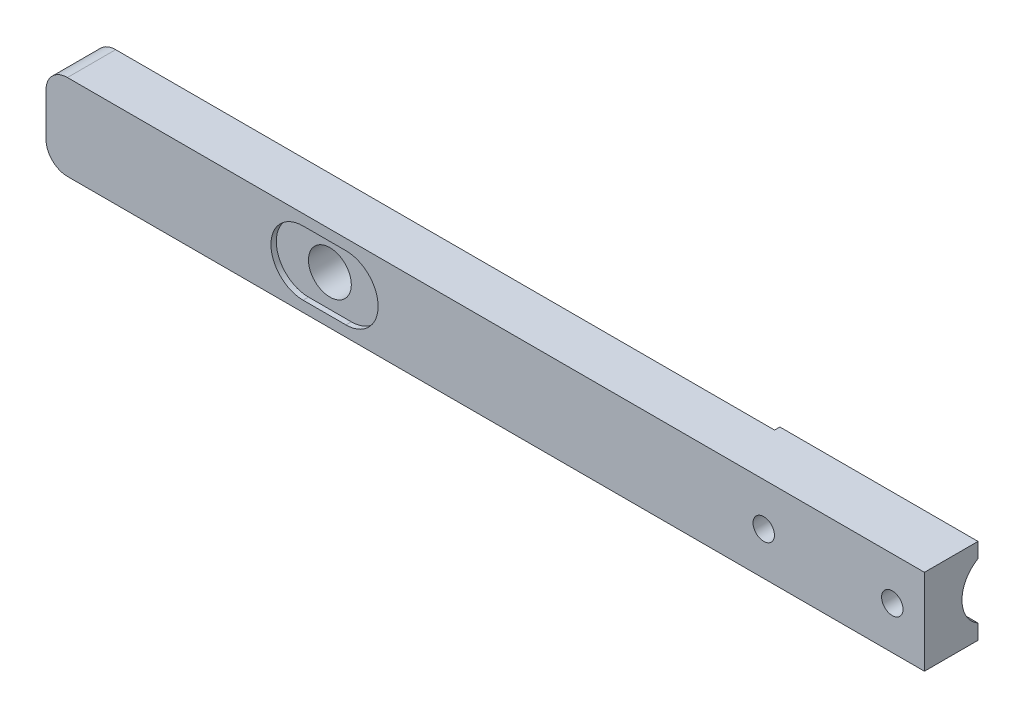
ISO-10303-21;
HEADER;
FILE_DESCRIPTION(('STEP AP214'),'2;1');
FILE_NAME('part.step','',(''),(''),'','','');
FILE_SCHEMA(('AUTOMOTIVE_DESIGN { 1 0 10303 214 1 1 1 1 }'));
ENDSEC;
DATA;
#1=APPLICATION_CONTEXT('core data for automotive mechanical design processes');
#2=APPLICATION_PROTOCOL_DEFINITION('international standard','automotive_design',2000,#1);
#3=PRODUCT_CONTEXT('',#1,'mechanical');
#4=PRODUCT('Part','Part','',(#3));
#5=PRODUCT_RELATED_PRODUCT_CATEGORY('part','',(#4));
#6=PRODUCT_DEFINITION_FORMATION('','',#4);
#7=PRODUCT_DEFINITION_CONTEXT('part definition',#1,'design');
#8=PRODUCT_DEFINITION('design','',#6,#7);
#9=PRODUCT_DEFINITION_SHAPE('','',#8);
#10=(LENGTH_UNIT() NAMED_UNIT(*) SI_UNIT(.MILLI.,.METRE.));
#11=(NAMED_UNIT(*) PLANE_ANGLE_UNIT() SI_UNIT($,.RADIAN.));
#12=(NAMED_UNIT(*) SI_UNIT($,.STERADIAN.) SOLID_ANGLE_UNIT());
#13=UNCERTAINTY_MEASURE_WITH_UNIT(LENGTH_MEASURE(1.E-05),#10,'distance_accuracy_value','');
#14=(GEOMETRIC_REPRESENTATION_CONTEXT(3) GLOBAL_UNCERTAINTY_ASSIGNED_CONTEXT((#13)) GLOBAL_UNIT_ASSIGNED_CONTEXT((#10,
#11,#12)) REPRESENTATION_CONTEXT('',''));
#15=CARTESIAN_POINT('',(0.,0.,0.));
#16=DIRECTION('',(0.,0.,1.));
#17=DIRECTION('',(1.,0.,0.));
#18=AXIS2_PLACEMENT_3D('',#15,#16,#17);
#19=CARTESIAN_POINT('',(0.,0.,7.9375));
#20=DIRECTION('',(0.,0.,1.));
#21=DIRECTION('',(1.,0.,0.));
#22=AXIS2_PLACEMENT_3D('',#19,#20,#21);
#23=PLANE('',#22);
#24=CARTESIAN_POINT('',(130.175,0.,7.9375));
#25=DIRECTION('',(0.,0.,1.));
#26=DIRECTION('',(1.,0.,0.));
#27=AXIS2_PLACEMENT_3D('',#24,#25,#26);
#28=CIRCLE('',#27,3.175);
#29=CARTESIAN_POINT('',(133.35,0.,7.9375));
#30=VERTEX_POINT('',#29);
#31=EDGE_CURVE('E356',#30,#30,#28,.T.);
#32=ORIENTED_EDGE('',*,*,#31,.F.);
#33=EDGE_LOOP('',(#32));
#34=FACE_BOUND('',#33,.T.);
#35=DIRECTION('',(0.,-1.,0.));
#36=VECTOR('',#35,1.);
#37=CARTESIAN_POINT('',(-82.55,12.7,7.9375));
#38=LINE('',#37,#36);
#39=CARTESIAN_POINT('',(-82.55,6.35,7.9375));
#40=VERTEX_POINT('',#39);
#41=CARTESIAN_POINT('',(-82.55,-6.35,7.9375));
#42=VERTEX_POINT('',#41);
#43=EDGE_CURVE('E328',#40,#42,#38,.T.);
#44=ORIENTED_EDGE('',*,*,#43,.T.);
#45=CARTESIAN_POINT('',(-76.2,-6.35,7.9375));
#46=DIRECTION('',(0.,0.,1.));
#47=DIRECTION('',(1.,0.,0.));
#48=AXIS2_PLACEMENT_3D('',#45,#46,#47);
#49=CIRCLE('',#48,6.35);
#50=CARTESIAN_POINT('',(-76.2,-12.7,7.9375));
#51=VERTEX_POINT('',#50);
#52=EDGE_CURVE('E312',#42,#51,#49,.T.);
#53=ORIENTED_EDGE('',*,*,#52,.T.);
#54=DIRECTION('',(1.,0.,0.));
#55=VECTOR('',#54,1.);
#56=CARTESIAN_POINT('',(-82.55,-12.7,7.9375));
#57=LINE('',#56,#55);
#58=CARTESIAN_POINT('',(177.8,-12.7,7.9375));
#59=VERTEX_POINT('',#58);
#60=EDGE_CURVE('E299',#51,#59,#57,.T.);
#61=ORIENTED_EDGE('',*,*,#60,.T.);
#62=DIRECTION('',(0.,1.,0.));
#63=VECTOR('',#62,1.);
#64=CARTESIAN_POINT('',(177.8,-12.7,7.9375));
#65=LINE('',#64,#63);
#66=CARTESIAN_POINT('',(177.8,12.7,7.9375));
#67=VERTEX_POINT('',#66);
#68=EDGE_CURVE('E324',#59,#67,#65,.T.);
#69=ORIENTED_EDGE('',*,*,#68,.T.);
#70=DIRECTION('',(-1.,0.,0.));
#71=VECTOR('',#70,1.);
#72=CARTESIAN_POINT('',(177.8,12.7,7.9375));
#73=LINE('',#72,#71);
#74=CARTESIAN_POINT('',(-76.2,12.7,7.9375));
#75=VERTEX_POINT('',#74);
#76=EDGE_CURVE('E319',#67,#75,#73,.T.);
#77=ORIENTED_EDGE('',*,*,#76,.T.);
#78=CARTESIAN_POINT('',(-76.2,6.35,7.9375));
#79=DIRECTION('',(0.,0.,1.));
#80=DIRECTION('',(1.,0.,0.));
#81=AXIS2_PLACEMENT_3D('',#78,#79,#80);
#82=CIRCLE('',#81,6.35);
#83=EDGE_CURVE('E311',#75,#40,#82,.T.);
#84=ORIENTED_EDGE('',*,*,#83,.T.);
#85=EDGE_LOOP('',(#44,#53,#61,#69,#77,#84));
#86=FACE_BOUND('',#85,.T.);
#87=CARTESIAN_POINT('',(168.275,0.,7.9375));
#88=DIRECTION('',(0.,0.,1.));
#89=DIRECTION('',(1.,0.,0.));
#90=AXIS2_PLACEMENT_3D('',#87,#88,#89);
#91=CIRCLE('',#90,3.175);
#92=CARTESIAN_POINT('',(171.45,0.,7.9375));
#93=VERTEX_POINT('',#92);
#94=EDGE_CURVE('E335',#93,#93,#91,.T.);
#95=ORIENTED_EDGE('',*,*,#94,.F.);
#96=EDGE_LOOP('',(#95));
#97=FACE_BOUND('',#96,.T.);
#98=DIRECTION('',(-1.,0.,0.));
#99=VECTOR('',#98,1.);
#100=CARTESIAN_POINT('',(0.,-9.525,7.9375));
#101=LINE('',#100,#99);
#102=CARTESIAN_POINT('',(6.35,-9.525,7.93750000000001));
#103=VERTEX_POINT('',#102);
#104=CARTESIAN_POINT('',(-6.35,-9.525,7.93750000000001));
#105=VERTEX_POINT('',#104);
#106=EDGE_CURVE('E41',#103,#105,#101,.T.);
#107=ORIENTED_EDGE('',*,*,#106,.T.);
#108=CARTESIAN_POINT('',(-6.35,0.,7.9375));
#109=DIRECTION('',(0.,0.,1.));
#110=DIRECTION('',(1.,0.,0.));
#111=AXIS2_PLACEMENT_3D('',#108,#109,#110);
#112=CIRCLE('',#111,9.525);
#113=CARTESIAN_POINT('',(-6.35,9.525,7.93750000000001));
#114=VERTEX_POINT('',#113);
#115=EDGE_CURVE('E11',#105,#114,#112,.F.);
#116=ORIENTED_EDGE('',*,*,#115,.T.);
#117=DIRECTION('',(1.,0.,0.));
#118=VECTOR('',#117,1.);
#119=CARTESIAN_POINT('',(0.,9.525,7.9375));
#120=LINE('',#119,#118);
#121=CARTESIAN_POINT('',(6.35,9.525,7.9375));
#122=VERTEX_POINT('',#121);
#123=EDGE_CURVE('E231',#114,#122,#120,.T.);
#124=ORIENTED_EDGE('',*,*,#123,.T.);
#125=CARTESIAN_POINT('',(6.35,0.,7.9375));
#126=DIRECTION('',(0.,0.,1.));
#127=DIRECTION('',(1.,0.,0.));
#128=AXIS2_PLACEMENT_3D('',#125,#126,#127);
#129=CIRCLE('',#128,9.525);
#130=EDGE_CURVE('E236',#122,#103,#129,.F.);
#131=ORIENTED_EDGE('',*,*,#130,.T.);
#132=EDGE_LOOP('',(#107,#116,#124,#131));
#133=FACE_BOUND('',#132,.T.);
#134=ADVANCED_FACE('F33',(#34,#86,#97,#133),#23,.T.);
#135=CARTESIAN_POINT('',(0.,0.,7.9375));
#136=DIRECTION('',(0.,0.,-1.));
#137=DIRECTION('',(-1.,0.,0.));
#138=AXIS2_PLACEMENT_3D('',#135,#136,#137);
#139=CYLINDRICAL_SURFACE('',#138,6.35);
#140=CARTESIAN_POINT('',(0.,0.,-6.36269999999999));
#141=DIRECTION('',(0.,0.,1.));
#142=DIRECTION('',(1.,0.,0.));
#143=AXIS2_PLACEMENT_3D('',#140,#141,#142);
#144=CIRCLE('',#143,6.35);
#145=CARTESIAN_POINT('',(6.35,0.,-6.36269999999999));
#146=VERTEX_POINT('',#145);
#147=EDGE_CURVE('E180',#146,#146,#144,.T.);
#148=ORIENTED_EDGE('',*,*,#147,.F.);
#149=EDGE_LOOP('',(#148));
#150=FACE_BOUND('',#149,.T.);
#151=CARTESIAN_POINT('',(0.,0.,6.35));
#152=DIRECTION('',(0.,0.,1.));
#153=DIRECTION('',(1.,0.,0.));
#154=AXIS2_PLACEMENT_3D('',#151,#152,#153);
#155=CIRCLE('',#154,6.35);
#156=CARTESIAN_POINT('',(6.35,0.,6.35));
#157=VERTEX_POINT('',#156);
#158=EDGE_CURVE('E142',#157,#157,#155,.T.);
#159=ORIENTED_EDGE('',*,*,#158,.T.);
#160=EDGE_LOOP('',(#159));
#161=FACE_BOUND('',#160,.T.);
#162=ADVANCED_FACE('F252',(#150,#161),#139,.F.);
#163=CARTESIAN_POINT('',(0.,0.,-7.9375));
#164=DIRECTION('',(0.,0.,1.));
#165=DIRECTION('',(1.,0.,0.));
#166=AXIS2_PLACEMENT_3D('',#163,#164,#165);
#167=PLANE('',#166);
#168=DIRECTION('',(1.,0.,0.));
#169=VECTOR('',#168,1.);
#170=CARTESIAN_POINT('',(-82.55,-12.7,-7.9375));
#171=LINE('',#170,#169);
#172=CARTESIAN_POINT('',(119.0752,-12.7,-7.9375));
#173=VERTEX_POINT('',#172);
#174=CARTESIAN_POINT('',(177.8,-12.7,-7.9375));
#175=VERTEX_POINT('',#174);
#176=EDGE_CURVE('E339',#173,#175,#171,.T.);
#177=ORIENTED_EDGE('',*,*,#176,.F.);
#178=DIRECTION('',(0.,1.,0.));
#179=VECTOR('',#178,1.);
#180=CARTESIAN_POINT('',(119.0752,-25.4,-7.9375));
#181=LINE('',#180,#179);
#182=CARTESIAN_POINT('',(119.0752,12.7,-7.9375));
#183=VERTEX_POINT('',#182);
#184=EDGE_CURVE('E165',#173,#183,#181,.T.);
#185=ORIENTED_EDGE('',*,*,#184,.T.);
#186=DIRECTION('',(-1.,0.,0.));
#187=VECTOR('',#186,1.);
#188=CARTESIAN_POINT('',(177.8,12.7,-7.9375));
#189=LINE('',#188,#187);
#190=CARTESIAN_POINT('',(177.8,12.7,-7.9375));
#191=VERTEX_POINT('',#190);
#192=EDGE_CURVE('E329',#191,#183,#189,.T.);
#193=ORIENTED_EDGE('',*,*,#192,.F.);
#194=DIRECTION('',(0.,1.,0.));
#195=VECTOR('',#194,1.);
#196=CARTESIAN_POINT('',(177.8,-12.7,-7.9375));
#197=LINE('',#196,#195);
#198=CARTESIAN_POINT('',(177.8,8.24889197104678,-7.9375));
#199=VERTEX_POINT('',#198);
#200=EDGE_CURVE('E341',#199,#191,#197,.T.);
#201=ORIENTED_EDGE('',*,*,#200,.F.);
#202=DIRECTION('',(1.,0.,0.));
#203=VECTOR('',#202,1.);
#204=CARTESIAN_POINT('',(120.65,8.24889197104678,-7.9375));
#205=LINE('',#204,#203);
#206=CARTESIAN_POINT('',(120.65,8.24889197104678,-7.9375));
#207=VERTEX_POINT('',#206);
#208=EDGE_CURVE('E199',#199,#207,#205,.F.);
#209=ORIENTED_EDGE('',*,*,#208,.T.);
#210=DIRECTION('',(0.,1.,0.));
#211=VECTOR('',#210,1.);
#212=CARTESIAN_POINT('',(120.65,0.,-7.9375));
#213=LINE('',#212,#211);
#214=CARTESIAN_POINT('',(120.65,-8.24889197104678,-7.9375));
#215=VERTEX_POINT('',#214);
#216=EDGE_CURVE('E224',#215,#207,#213,.T.);
#217=ORIENTED_EDGE('',*,*,#216,.F.);
#218=DIRECTION('',(1.,0.,0.));
#219=VECTOR('',#218,1.);
#220=CARTESIAN_POINT('',(120.65,-8.24889197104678,-7.9375));
#221=LINE('',#220,#219);
#222=CARTESIAN_POINT('',(177.8,-8.24889197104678,-7.9375));
#223=VERTEX_POINT('',#222);
#224=EDGE_CURVE('E353',#215,#223,#221,.T.);
#225=ORIENTED_EDGE('',*,*,#224,.T.);
#226=EDGE_CURVE('E332',#175,#223,#197,.T.);
#227=ORIENTED_EDGE('',*,*,#226,.F.);
#228=EDGE_LOOP('',(#177,#185,#193,#201,#209,#217,#225,#227));
#229=FACE_BOUND('',#228,.T.);
#230=ADVANCED_FACE('F258',(#229),#167,.F.);
#231=CARTESIAN_POINT('',(-82.55,12.7,7.9375));
#232=DIRECTION('',(1.,0.,0.));
#233=DIRECTION('',(0.,0.,-1.));
#234=AXIS2_PLACEMENT_3D('',#231,#232,#233);
#235=PLANE('',#234);
#236=DIRECTION('',(0.,0.,-1.));
#237=VECTOR('',#236,1.);
#238=CARTESIAN_POINT('',(-82.55,6.35,7.9375));
#239=LINE('',#238,#237);
#240=CARTESIAN_POINT('',(-82.55,6.35,-6.36269999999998));
#241=VERTEX_POINT('',#240);
#242=EDGE_CURVE('E300',#40,#241,#239,.T.);
#243=ORIENTED_EDGE('',*,*,#242,.T.);
#244=DIRECTION('',(0.,1.,0.));
#245=VECTOR('',#244,1.);
#246=CARTESIAN_POINT('',(-82.55,-25.4,-6.36269999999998));
#247=LINE('',#246,#245);
#248=CARTESIAN_POINT('',(-82.55,-6.35,-6.36269999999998));
#249=VERTEX_POINT('',#248);
#250=EDGE_CURVE('E56',#249,#241,#247,.T.);
#251=ORIENTED_EDGE('',*,*,#250,.F.);
#252=DIRECTION('',(0.,0.,-1.));
#253=VECTOR('',#252,1.);
#254=CARTESIAN_POINT('',(-82.55,-6.35,7.9375));
#255=LINE('',#254,#253);
#256=EDGE_CURVE('E296',#249,#42,#255,.F.);
#257=ORIENTED_EDGE('',*,*,#256,.T.);
#258=ORIENTED_EDGE('',*,*,#43,.F.);
#259=EDGE_LOOP('',(#243,#251,#257,#258));
#260=FACE_BOUND('',#259,.T.);
#261=ADVANCED_FACE('F265',(#260),#235,.F.);
#262=CARTESIAN_POINT('',(-82.55,-12.7,7.9375));
#263=DIRECTION('',(0.,1.,0.));
#264=DIRECTION('',(0.,0.,1.));
#265=AXIS2_PLACEMENT_3D('',#262,#263,#264);
#266=PLANE('',#265);
#267=DIRECTION('',(1.,0.,0.));
#268=VECTOR('',#267,1.);
#269=CARTESIAN_POINT('',(-82.55,-12.7,-6.36269999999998));
#270=LINE('',#269,#268);
#271=CARTESIAN_POINT('',(-76.2,-12.7,-6.36269999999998));
#272=VERTEX_POINT('',#271);
#273=CARTESIAN_POINT('',(119.0752,-12.7,-6.3627));
#274=VERTEX_POINT('',#273);
#275=EDGE_CURVE('E177',#272,#274,#270,.T.);
#276=ORIENTED_EDGE('',*,*,#275,.T.);
#277=DIRECTION('',(0.,0.,-1.));
#278=VECTOR('',#277,1.);
#279=CARTESIAN_POINT('',(119.0752,-12.7,7.9375));
#280=LINE('',#279,#278);
#281=EDGE_CURVE('E183',#274,#173,#280,.T.);
#282=ORIENTED_EDGE('',*,*,#281,.T.);
#283=ORIENTED_EDGE('',*,*,#176,.T.);
#284=DIRECTION('',(0.,0.,-1.));
#285=VECTOR('',#284,1.);
#286=CARTESIAN_POINT('',(177.8,-12.7,7.9375));
#287=LINE('',#286,#285);
#288=EDGE_CURVE('E301',#59,#175,#287,.T.);
#289=ORIENTED_EDGE('',*,*,#288,.F.);
#290=ORIENTED_EDGE('',*,*,#60,.F.);
#291=DIRECTION('',(0.,0.,-1.));
#292=VECTOR('',#291,1.);
#293=CARTESIAN_POINT('',(-76.2,-12.7,7.9375));
#294=LINE('',#293,#292);
#295=EDGE_CURVE('E295',#51,#272,#294,.T.);
#296=ORIENTED_EDGE('',*,*,#295,.T.);
#297=EDGE_LOOP('',(#276,#282,#283,#289,#290,#296));
#298=FACE_BOUND('',#297,.T.);
#299=ADVANCED_FACE('F274',(#298),#266,.F.);
#300=CARTESIAN_POINT('',(177.8,-12.7,7.9375));
#301=DIRECTION('',(-1.,0.,0.));
#302=DIRECTION('',(0.,0.,1.));
#303=AXIS2_PLACEMENT_3D('',#300,#301,#302);
#304=PLANE('',#303);
#305=ORIENTED_EDGE('',*,*,#226,.T.);
#306=CARTESIAN_POINT('',(177.8,0.,-12.7));
#307=DIRECTION('',(1.,0.,0.));
#308=DIRECTION('',(0.,0.,-1.));
#309=AXIS2_PLACEMENT_3D('',#306,#307,#308);
#310=CIRCLE('',#309,9.525);
#311=EDGE_CURVE('E186',#199,#223,#310,.T.);
#312=ORIENTED_EDGE('',*,*,#311,.F.);
#313=ORIENTED_EDGE('',*,*,#200,.T.);
#314=DIRECTION('',(0.,0.,-1.));
#315=VECTOR('',#314,1.);
#316=CARTESIAN_POINT('',(177.8,12.7,7.9375));
#317=LINE('',#316,#315);
#318=EDGE_CURVE('E306',#67,#191,#317,.T.);
#319=ORIENTED_EDGE('',*,*,#318,.F.);
#320=ORIENTED_EDGE('',*,*,#68,.F.);
#321=ORIENTED_EDGE('',*,*,#288,.T.);
#322=EDGE_LOOP('',(#305,#312,#313,#319,#320,#321));
#323=FACE_BOUND('',#322,.T.);
#324=ADVANCED_FACE('F270',(#323),#304,.F.);
#325=CARTESIAN_POINT('',(177.8,12.7,7.9375));
#326=DIRECTION('',(0.,-1.,0.));
#327=DIRECTION('',(0.,0.,-1.));
#328=AXIS2_PLACEMENT_3D('',#325,#326,#327);
#329=PLANE('',#328);
#330=ORIENTED_EDGE('',*,*,#192,.T.);
#331=DIRECTION('',(0.,0.,1.));
#332=VECTOR('',#331,1.);
#333=CARTESIAN_POINT('',(119.0752,12.7,7.9375));
#334=LINE('',#333,#332);
#335=CARTESIAN_POINT('',(119.0752,12.7,-6.3627));
#336=VERTEX_POINT('',#335);
#337=EDGE_CURVE('E228',#183,#336,#334,.T.);
#338=ORIENTED_EDGE('',*,*,#337,.T.);
#339=DIRECTION('',(-1.,0.,0.));
#340=VECTOR('',#339,1.);
#341=CARTESIAN_POINT('',(177.8,12.7,-6.36270000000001));
#342=LINE('',#341,#340);
#343=CARTESIAN_POINT('',(-76.2,12.7,-6.36269999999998));
#344=VERTEX_POINT('',#343);
#345=EDGE_CURVE('E168',#336,#344,#342,.T.);
#346=ORIENTED_EDGE('',*,*,#345,.T.);
#347=DIRECTION('',(0.,0.,-1.));
#348=VECTOR('',#347,1.);
#349=CARTESIAN_POINT('',(-76.2,12.7,7.9375));
#350=LINE('',#349,#348);
#351=EDGE_CURVE('E222',#344,#75,#350,.F.);
#352=ORIENTED_EDGE('',*,*,#351,.T.);
#353=ORIENTED_EDGE('',*,*,#76,.F.);
#354=ORIENTED_EDGE('',*,*,#318,.T.);
#355=EDGE_LOOP('',(#330,#338,#346,#352,#353,#354));
#356=FACE_BOUND('',#355,.T.);
#357=ADVANCED_FACE('F267',(#356),#329,.F.);
#358=CARTESIAN_POINT('',(168.275,0.,7.9375));
#359=DIRECTION('',(0.,0.,-1.));
#360=DIRECTION('',(-1.,0.,0.));
#361=AXIS2_PLACEMENT_3D('',#358,#359,#360);
#362=CYLINDRICAL_SURFACE('',#361,3.175);
#363=CARTESIAN_POINT('',(165.1,0.,-3.175));
#364=CARTESIAN_POINT('',(165.099999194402,-0.173238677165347,-3.17499951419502));
#365=CARTESIAN_POINT('',(165.114224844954,-0.346472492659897,-3.17976981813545));
#366=CARTESIAN_POINT('',(165.170577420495,-0.687837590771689,-3.19832957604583));
#367=CARTESIAN_POINT('',(165.212707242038,-0.855968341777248,-3.21211996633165));
#368=CARTESIAN_POINT('',(165.323263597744,-1.18215660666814,-3.24722147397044));
#369=CARTESIAN_POINT('',(165.391646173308,-1.34023044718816,-3.2685200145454));
#370=CARTESIAN_POINT('',(165.552568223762,-1.64266542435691,-3.31646384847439));
#371=CARTESIAN_POINT('',(165.645112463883,-1.78702384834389,-3.34311019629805));
#372=CARTESIAN_POINT('',(165.855096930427,-2.0629298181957,-3.39997750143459));
#373=CARTESIAN_POINT('',(165.973224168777,-2.19393674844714,-3.43028408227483));
#374=CARTESIAN_POINT('',(166.229560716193,-2.43469379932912,-3.49058500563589));
#375=CARTESIAN_POINT('',(166.367774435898,-2.54443923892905,-3.52057927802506));
#376=CARTESIAN_POINT('',(166.665227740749,-2.74264419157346,-3.57780169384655));
#377=CARTESIAN_POINT('',(166.824957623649,-2.83040092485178,-3.6049255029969));
#378=CARTESIAN_POINT('',(167.157959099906,-2.97757492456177,-3.65203405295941));
#379=CARTESIAN_POINT('',(167.331226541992,-3.03700083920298,-3.67202097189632));
#380=CARTESIAN_POINT('',(167.680237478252,-3.12379824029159,-3.70169112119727));
#381=CARTESIAN_POINT('',(167.855700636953,-3.15218269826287,-3.71169895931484));
#382=CARTESIAN_POINT('',(168.209162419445,-3.17925806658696,-3.72123790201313));
#383=CARTESIAN_POINT('',(168.387160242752,-3.17795815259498,-3.72077224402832));
#384=CARTESIAN_POINT('',(168.73199880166,-3.14648819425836,-3.70970127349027));
#385=CARTESIAN_POINT('',(168.898977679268,-3.11764017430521,-3.69956029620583));
#386=CARTESIAN_POINT('',(169.225574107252,-3.03404956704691,-3.67104111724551));
#387=CARTESIAN_POINT('',(169.385190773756,-2.9793038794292,-3.65266192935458));
#388=CARTESIAN_POINT('',(169.695535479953,-2.84460650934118,-3.60940632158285));
#389=CARTESIAN_POINT('',(169.846078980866,-2.76426310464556,-3.58443003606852));
#390=CARTESIAN_POINT('',(170.131965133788,-2.58092291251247,-3.53083626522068));
#391=CARTESIAN_POINT('',(170.267303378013,-2.47791958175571,-3.50221772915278));
#392=CARTESIAN_POINT('',(170.52636582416,-2.2458341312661,-3.44273729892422));
#393=CARTESIAN_POINT('',(170.649114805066,-2.11567125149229,-3.41183628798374));
#394=CARTESIAN_POINT('',(170.871296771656,-1.83622813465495,-3.35257970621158));
#395=CARTESIAN_POINT('',(170.970727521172,-1.68694606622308,-3.32422437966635));
#396=CARTESIAN_POINT('',(171.144235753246,-1.37143367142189,-3.27288182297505));
#397=CARTESIAN_POINT('',(171.218051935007,-1.20504990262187,-3.24995063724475));
#398=CARTESIAN_POINT('',(171.336345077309,-0.861279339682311,-3.21244699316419));
#399=CARTESIAN_POINT('',(171.380832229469,-0.683896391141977,-3.19787163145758));
#400=CARTESIAN_POINT('',(171.437476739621,-0.331418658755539,-3.17920284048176));
#401=CARTESIAN_POINT('',(171.450951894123,-0.156557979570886,-3.17468244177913));
#402=CARTESIAN_POINT('',(171.448943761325,0.192960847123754,-3.17535233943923));
#403=CARTESIAN_POINT('',(171.433465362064,0.36761902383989,-3.18054099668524));
#404=CARTESIAN_POINT('',(171.375032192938,0.70650057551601,-3.19976421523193));
#405=CARTESIAN_POINT('',(171.332886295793,0.870879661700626,-3.21353819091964));
#406=CARTESIAN_POINT('',(171.223325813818,1.19016766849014,-3.24828386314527));
#407=CARTESIAN_POINT('',(171.15590800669,1.34507537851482,-3.26925647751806));
#408=CARTESIAN_POINT('',(170.995751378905,1.64556534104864,-3.31695643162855));
#409=CARTESIAN_POINT('',(170.902393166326,1.79079512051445,-3.34382063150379));
#410=CARTESIAN_POINT('',(170.693733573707,2.06395583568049,-3.40025818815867));
#411=CARTESIAN_POINT('',(170.578425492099,2.19188146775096,-3.42983237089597));
#412=CARTESIAN_POINT('',(170.322942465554,2.43285171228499,-3.49006007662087));
#413=CARTESIAN_POINT('',(170.181875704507,2.54495607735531,-3.52070158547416));
#414=CARTESIAN_POINT('',(169.8822752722,2.74401763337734,-3.57822584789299));
#415=CARTESIAN_POINT('',(169.723741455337,2.83097461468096,-3.60510857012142));
#416=CARTESIAN_POINT('',(169.393638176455,2.97687025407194,-3.65180906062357));
#417=CARTESIAN_POINT('',(169.222095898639,3.03586556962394,-3.67164109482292));
#418=CARTESIAN_POINT('',(168.87069778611,3.12386556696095,-3.70170607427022));
#419=CARTESIAN_POINT('',(168.690845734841,3.15288375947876,-3.71194334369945));
#420=CARTESIAN_POINT('',(168.33787422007,3.17905219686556,-3.72116798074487));
#421=CARTESIAN_POINT('',(168.164883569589,3.17776306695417,-3.72070629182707));
#422=CARTESIAN_POINT('',(167.821720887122,3.1471942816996,-3.70994718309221));
#423=CARTESIAN_POINT('',(167.651548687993,3.11791629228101,-3.69965034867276));
#424=CARTESIAN_POINT('',(167.322069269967,3.03330550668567,-3.67079135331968));
#425=CARTESIAN_POINT('',(167.162617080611,2.97847812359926,-3.65238988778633));
#426=CARTESIAN_POINT('',(166.855052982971,2.8447344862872,-3.60945433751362));
#427=CARTESIAN_POINT('',(166.706943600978,2.76581288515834,-3.58491889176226));
#428=CARTESIAN_POINT('',(166.419264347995,2.5821026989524,-3.53114517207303));
#429=CARTESIAN_POINT('',(166.280349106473,2.47633567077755,-3.50174840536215));
#430=CARTESIAN_POINT('',(166.021734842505,2.2435911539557,-3.44222843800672));
#431=CARTESIAN_POINT('',(165.90204127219,2.11660766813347,-3.41210503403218));
#432=CARTESIAN_POINT('',(165.680566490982,1.8390919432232,-3.35311653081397));
#433=CARTESIAN_POINT('',(165.579665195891,1.68783480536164,-3.3243462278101));
#434=CARTESIAN_POINT('',(165.404830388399,1.36955960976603,-3.27259978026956));
#435=CARTESIAN_POINT('',(165.330889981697,1.20254559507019,-3.24962215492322));
#436=CARTESIAN_POINT('',(165.215183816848,0.865167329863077,-3.21292489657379));
#437=CARTESIAN_POINT('',(165.172128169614,0.69528613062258,-3.1988375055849));
#438=CARTESIAN_POINT('',(165.11454060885,0.350267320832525,-3.17987657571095));
#439=CARTESIAN_POINT('',(165.100000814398,0.175131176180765,-3.17500049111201));
#440=CARTESIAN_POINT('',(165.1,0.,-3.175));
#441=B_SPLINE_CURVE_WITH_KNOTS('',3,(#363,#364,#365,#366,#367,#368,#369,#370,#371,#372,#373,
#374,#375,#376,#377,#378,#379,#380,#381,#382,#383,#384,#385,#386,#387,#388,#389,#390,#391,#392,
#393,#394,#395,#396,#397,#398,#399,#400,#401,#402,#403,#404,#405,#406,#407,#408,#409,#410,#411,
#412,#413,#414,#415,#416,#417,#418,#419,#420,#421,#422,#423,#424,#425,#426,#427,#428,#429,#430,
#431,#432,#433,#434,#435,#436,#437,#438,#439,#440),.UNSPECIFIED.,.T.,.F.,(4,2,2,2,2,2,2,2,2,2,2,
2,2,2,2,2,2,2,2,2,2,2,2,2,2,2,2,2,2,2,2,2,2,2,2,2,2,2,4),(0.,0.519071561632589,1.03819701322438,
1.55645698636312,2.07481924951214,2.60936372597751,3.1440257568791,3.69406121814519,
4.24392866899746,4.77526114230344,5.30642937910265,5.81332424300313,6.32027980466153,
6.83539943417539,7.35066800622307,7.8928374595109,8.43505888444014,8.98265937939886,
9.53006948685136,10.0537512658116,10.5773446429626,11.0857715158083,11.5942632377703,
12.1161301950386,12.638156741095,13.1839024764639,13.7296527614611,14.2742924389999,
14.8186865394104,15.3351123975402,15.8515075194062,16.3580948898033,16.8647947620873,
17.3936046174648,17.92256420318,18.4721392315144,19.0215736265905,19.5464607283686,
20.0712027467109),.UNSPECIFIED.);
#442=CARTESIAN_POINT('',(165.1,0.,-3.175));
#443=VERTEX_POINT('',#442);
#444=EDGE_CURVE('E192',#443,#443,#441,.T.);
#445=ORIENTED_EDGE('',*,*,#444,.F.);
#446=EDGE_LOOP('',(#445));
#447=FACE_BOUND('',#446,.T.);
#448=ORIENTED_EDGE('',*,*,#94,.T.);
#449=EDGE_LOOP('',(#448));
#450=FACE_BOUND('',#449,.T.);
#451=ADVANCED_FACE('F201',(#447,#450),#362,.F.);
#452=CARTESIAN_POINT('',(130.175,0.,7.9375));
#453=DIRECTION('',(0.,0.,-1.));
#454=DIRECTION('',(-1.,0.,0.));
#455=AXIS2_PLACEMENT_3D('',#452,#453,#454);
#456=CYLINDRICAL_SURFACE('',#455,3.175);
#457=CARTESIAN_POINT('',(127.,0.,-3.175));
#458=CARTESIAN_POINT('',(126.999999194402,-0.173238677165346,-3.17499951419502));
#459=CARTESIAN_POINT('',(127.014224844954,-0.346472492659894,-3.17976981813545));
#460=CARTESIAN_POINT('',(127.070577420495,-0.687837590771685,-3.19832957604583));
#461=CARTESIAN_POINT('',(127.112707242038,-0.855968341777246,-3.21211996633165));
#462=CARTESIAN_POINT('',(127.223263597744,-1.18215660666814,-3.24722147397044));
#463=CARTESIAN_POINT('',(127.291646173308,-1.34023044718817,-3.2685200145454));
#464=CARTESIAN_POINT('',(127.452568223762,-1.64266542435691,-3.3164638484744));
#465=CARTESIAN_POINT('',(127.545112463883,-1.7870238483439,-3.34311019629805));
#466=CARTESIAN_POINT('',(127.755096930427,-2.0629298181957,-3.39997750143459));
#467=CARTESIAN_POINT('',(127.873224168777,-2.19393674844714,-3.43028408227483));
#468=CARTESIAN_POINT('',(128.129560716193,-2.43469379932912,-3.49058500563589));
#469=CARTESIAN_POINT('',(128.267774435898,-2.54443923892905,-3.52057927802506));
#470=CARTESIAN_POINT('',(128.565227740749,-2.74264419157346,-3.57780169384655));
#471=CARTESIAN_POINT('',(128.724957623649,-2.83040092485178,-3.6049255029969));
#472=CARTESIAN_POINT('',(129.057959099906,-2.97757492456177,-3.65203405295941));
#473=CARTESIAN_POINT('',(129.231226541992,-3.03700083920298,-3.67202097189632));
#474=CARTESIAN_POINT('',(129.580237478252,-3.12379824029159,-3.70169112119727));
#475=CARTESIAN_POINT('',(129.755700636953,-3.15218269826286,-3.71169895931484));
#476=CARTESIAN_POINT('',(130.109162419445,-3.17925806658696,-3.72123790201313));
#477=CARTESIAN_POINT('',(130.287160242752,-3.17795815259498,-3.72077224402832));
#478=CARTESIAN_POINT('',(130.63199880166,-3.14648819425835,-3.70970127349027));
#479=CARTESIAN_POINT('',(130.798977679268,-3.11764017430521,-3.69956029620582));
#480=CARTESIAN_POINT('',(131.125574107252,-3.0340495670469,-3.6710411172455));
#481=CARTESIAN_POINT('',(131.285190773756,-2.9793038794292,-3.65266192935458));
#482=CARTESIAN_POINT('',(131.595535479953,-2.84460650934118,-3.60940632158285));
#483=CARTESIAN_POINT('',(131.746078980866,-2.76426310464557,-3.58443003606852));
#484=CARTESIAN_POINT('',(132.031965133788,-2.58092291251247,-3.53083626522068));
#485=CARTESIAN_POINT('',(132.167303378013,-2.47791958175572,-3.50221772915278));
#486=CARTESIAN_POINT('',(132.42636582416,-2.2458341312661,-3.44273729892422));
#487=CARTESIAN_POINT('',(132.549114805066,-2.11567125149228,-3.41183628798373));
#488=CARTESIAN_POINT('',(132.771296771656,-1.83622813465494,-3.35257970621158));
#489=CARTESIAN_POINT('',(132.870727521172,-1.68694606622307,-3.32422437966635));
#490=CARTESIAN_POINT('',(133.044235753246,-1.37143367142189,-3.27288182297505));
#491=CARTESIAN_POINT('',(133.118051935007,-1.20504990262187,-3.24995063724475));
#492=CARTESIAN_POINT('',(133.236345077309,-0.861279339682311,-3.21244699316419));
#493=CARTESIAN_POINT('',(133.280832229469,-0.683896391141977,-3.19787163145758));
#494=CARTESIAN_POINT('',(133.337476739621,-0.331418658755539,-3.17920284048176));
#495=CARTESIAN_POINT('',(133.350951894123,-0.156557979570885,-3.17468244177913));
#496=CARTESIAN_POINT('',(133.348943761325,0.192960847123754,-3.17535233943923));
#497=CARTESIAN_POINT('',(133.333465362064,0.36761902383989,-3.18054099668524));
#498=CARTESIAN_POINT('',(133.275032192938,0.706500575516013,-3.19976421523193));
#499=CARTESIAN_POINT('',(133.232886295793,0.870879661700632,-3.21353819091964));
#500=CARTESIAN_POINT('',(133.123325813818,1.19016766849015,-3.24828386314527));
#501=CARTESIAN_POINT('',(133.05590800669,1.34507537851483,-3.26925647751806));
#502=CARTESIAN_POINT('',(132.895751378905,1.64556534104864,-3.31695643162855));
#503=CARTESIAN_POINT('',(132.802393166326,1.79079512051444,-3.34382063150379));
#504=CARTESIAN_POINT('',(132.593733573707,2.06395583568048,-3.40025818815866));
#505=CARTESIAN_POINT('',(132.478425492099,2.19188146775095,-3.42983237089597));
#506=CARTESIAN_POINT('',(132.222942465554,2.432851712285,-3.49006007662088));
#507=CARTESIAN_POINT('',(132.081875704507,2.54495607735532,-3.52070158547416));
#508=CARTESIAN_POINT('',(131.7822752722,2.74401763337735,-3.57822584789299));
#509=CARTESIAN_POINT('',(131.623741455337,2.83097461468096,-3.60510857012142));
#510=CARTESIAN_POINT('',(131.293638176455,2.97687025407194,-3.65180906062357));
#511=CARTESIAN_POINT('',(131.122095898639,3.03586556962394,-3.67164109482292));
#512=CARTESIAN_POINT('',(130.77069778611,3.12386556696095,-3.70170607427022));
#513=CARTESIAN_POINT('',(130.590845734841,3.15288375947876,-3.71194334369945));
#514=CARTESIAN_POINT('',(130.23787422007,3.17905219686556,-3.72116798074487));
#515=CARTESIAN_POINT('',(130.064883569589,3.17776306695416,-3.72070629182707));
#516=CARTESIAN_POINT('',(129.721720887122,3.1471942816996,-3.70994718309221));
#517=CARTESIAN_POINT('',(129.551548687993,3.11791629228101,-3.69965034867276));
#518=CARTESIAN_POINT('',(129.222069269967,3.03330550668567,-3.67079135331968));
#519=CARTESIAN_POINT('',(129.062617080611,2.97847812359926,-3.65238988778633));
#520=CARTESIAN_POINT('',(128.755052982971,2.84473448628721,-3.60945433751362));
#521=CARTESIAN_POINT('',(128.606943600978,2.76581288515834,-3.58491889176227));
#522=CARTESIAN_POINT('',(128.319264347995,2.5821026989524,-3.53114517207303));
#523=CARTESIAN_POINT('',(128.180349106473,2.47633567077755,-3.50174840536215));
#524=CARTESIAN_POINT('',(127.921734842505,2.2435911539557,-3.44222843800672));
#525=CARTESIAN_POINT('',(127.80204127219,2.11660766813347,-3.41210503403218));
#526=CARTESIAN_POINT('',(127.580566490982,1.8390919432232,-3.35311653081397));
#527=CARTESIAN_POINT('',(127.479665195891,1.68783480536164,-3.3243462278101));
#528=CARTESIAN_POINT('',(127.304830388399,1.36955960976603,-3.27259978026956));
#529=CARTESIAN_POINT('',(127.230889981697,1.20254559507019,-3.24962215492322));
#530=CARTESIAN_POINT('',(127.115183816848,0.865167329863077,-3.21292489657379));
#531=CARTESIAN_POINT('',(127.072128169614,0.69528613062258,-3.1988375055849));
#532=CARTESIAN_POINT('',(127.01454060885,0.350267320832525,-3.17987657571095));
#533=CARTESIAN_POINT('',(127.000000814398,0.175131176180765,-3.17500049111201));
#534=CARTESIAN_POINT('',(127.,0.,-3.175));
#535=B_SPLINE_CURVE_WITH_KNOTS('',3,(#457,#458,#459,#460,#461,#462,#463,#464,#465,#466,#467,
#468,#469,#470,#471,#472,#473,#474,#475,#476,#477,#478,#479,#480,#481,#482,#483,#484,#485,#486,
#487,#488,#489,#490,#491,#492,#493,#494,#495,#496,#497,#498,#499,#500,#501,#502,#503,#504,#505,
#506,#507,#508,#509,#510,#511,#512,#513,#514,#515,#516,#517,#518,#519,#520,#521,#522,#523,#524,
#525,#526,#527,#528,#529,#530,#531,#532,#533,#534),.UNSPECIFIED.,.T.,.F.,(4,2,2,2,2,2,2,2,2,2,2,
2,2,2,2,2,2,2,2,2,2,2,2,2,2,2,2,2,2,2,2,2,2,2,2,2,2,2,4),(0.,0.519071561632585,1.03819701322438,
1.55645698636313,2.07481924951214,2.60936372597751,3.1440257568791,3.69406121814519,
4.24392866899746,4.77526114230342,5.30642937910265,5.81332424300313,6.32027980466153,
6.83539943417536,7.35066800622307,7.89283745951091,8.43505888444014,8.98265937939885,
9.53006948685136,10.0537512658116,10.5773446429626,11.0857715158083,11.5942632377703,
12.1161301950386,12.638156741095,13.1839024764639,13.7296527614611,14.274292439,
14.8186865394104,15.3351123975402,15.8515075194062,16.3580948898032,16.8647947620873,
17.3936046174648,17.92256420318,18.4721392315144,19.0215736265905,19.5464607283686,
20.0712027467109),.UNSPECIFIED.);
#536=CARTESIAN_POINT('',(127.,0.,-3.175));
#537=VERTEX_POINT('',#536);
#538=EDGE_CURVE('E190',#537,#537,#535,.T.);
#539=ORIENTED_EDGE('',*,*,#538,.F.);
#540=EDGE_LOOP('',(#539));
#541=FACE_BOUND('',#540,.T.);
#542=ORIENTED_EDGE('',*,*,#31,.T.);
#543=EDGE_LOOP('',(#542));
#544=FACE_BOUND('',#543,.T.);
#545=ADVANCED_FACE('F213',(#541,#544),#456,.F.);
#546=CARTESIAN_POINT('',(-76.2,-6.35,7.9375));
#547=DIRECTION('',(0.,0.,-1.));
#548=DIRECTION('',(-1.,0.,0.));
#549=AXIS2_PLACEMENT_3D('',#546,#547,#548);
#550=CYLINDRICAL_SURFACE('',#549,6.35);
#551=CARTESIAN_POINT('',(-76.2,-6.35,-6.36269999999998));
#552=DIRECTION('',(0.,0.,1.));
#553=DIRECTION('',(1.,0.,0.));
#554=AXIS2_PLACEMENT_3D('',#551,#552,#553);
#555=CIRCLE('',#554,6.35);
#556=EDGE_CURVE('E175',#272,#249,#555,.F.);
#557=ORIENTED_EDGE('',*,*,#556,.F.);
#558=ORIENTED_EDGE('',*,*,#295,.F.);
#559=ORIENTED_EDGE('',*,*,#52,.F.);
#560=ORIENTED_EDGE('',*,*,#256,.F.);
#561=EDGE_LOOP('',(#557,#558,#559,#560));
#562=FACE_BOUND('',#561,.T.);
#563=ADVANCED_FACE('F281',(#562),#550,.T.);
#564=CARTESIAN_POINT('',(-76.2,6.35,7.9375));
#565=DIRECTION('',(0.,0.,-1.));
#566=DIRECTION('',(-1.,0.,0.));
#567=AXIS2_PLACEMENT_3D('',#564,#565,#566);
#568=CYLINDRICAL_SURFACE('',#567,6.35);
#569=CARTESIAN_POINT('',(-76.2,6.35,-6.36269999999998));
#570=DIRECTION('',(0.,0.,1.));
#571=DIRECTION('',(1.,0.,0.));
#572=AXIS2_PLACEMENT_3D('',#569,#570,#571);
#573=CIRCLE('',#572,6.35);
#574=EDGE_CURVE('E226',#241,#344,#573,.F.);
#575=ORIENTED_EDGE('',*,*,#574,.F.);
#576=ORIENTED_EDGE('',*,*,#242,.F.);
#577=ORIENTED_EDGE('',*,*,#83,.F.);
#578=ORIENTED_EDGE('',*,*,#351,.F.);
#579=EDGE_LOOP('',(#575,#576,#577,#578));
#580=FACE_BOUND('',#579,.T.);
#581=ADVANCED_FACE('F35',(#580),#568,.T.);
#582=CARTESIAN_POINT('',(120.65,0.,-12.7));
#583=DIRECTION('',(1.,0.,0.));
#584=DIRECTION('',(0.,0.,-1.));
#585=AXIS2_PLACEMENT_3D('',#582,#583,#584);
#586=PLANE('',#585);
#587=ORIENTED_EDGE('',*,*,#216,.T.);
#588=CARTESIAN_POINT('',(120.65,0.,-12.7));
#589=DIRECTION('',(1.,0.,0.));
#590=DIRECTION('',(0.,0.,-1.));
#591=AXIS2_PLACEMENT_3D('',#588,#589,#590);
#592=CIRCLE('',#591,9.525);
#593=EDGE_CURVE('E187',#207,#215,#592,.T.);
#594=ORIENTED_EDGE('',*,*,#593,.T.);
#595=EDGE_LOOP('',(#587,#594));
#596=FACE_BOUND('',#595,.T.);
#597=ADVANCED_FACE('F210',(#596),#586,.T.);
#598=CARTESIAN_POINT('',(120.65,0.,-12.7));
#599=DIRECTION('',(1.,0.,0.));
#600=DIRECTION('',(0.,0.,-1.));
#601=AXIS2_PLACEMENT_3D('',#598,#599,#600);
#602=CYLINDRICAL_SURFACE('',#601,9.525);
#603=ORIENTED_EDGE('',*,*,#538,.T.);
#604=EDGE_LOOP('',(#603));
#605=FACE_BOUND('',#604,.T.);
#606=ORIENTED_EDGE('',*,*,#444,.T.);
#607=EDGE_LOOP('',(#606));
#608=FACE_BOUND('',#607,.T.);
#609=ORIENTED_EDGE('',*,*,#593,.F.);
#610=ORIENTED_EDGE('',*,*,#208,.F.);
#611=ORIENTED_EDGE('',*,*,#311,.T.);
#612=ORIENTED_EDGE('',*,*,#224,.F.);
#613=EDGE_LOOP('',(#609,#610,#611,#612));
#614=FACE_BOUND('',#613,.T.);
#615=ADVANCED_FACE('F205',(#605,#608,#614),#602,.F.);
#616=CARTESIAN_POINT('',(119.0752,-25.4,-7.9375));
#617=DIRECTION('',(1.,0.,0.));
#618=DIRECTION('',(0.,0.,-1.));
#619=AXIS2_PLACEMENT_3D('',#616,#617,#618);
#620=PLANE('',#619);
#621=DIRECTION('',(0.,1.,0.));
#622=VECTOR('',#621,1.);
#623=CARTESIAN_POINT('',(119.0752,-25.4,-6.3627));
#624=LINE('',#623,#622);
#625=EDGE_CURVE('E169',#274,#336,#624,.T.);
#626=ORIENTED_EDGE('',*,*,#625,.T.);
#627=ORIENTED_EDGE('',*,*,#337,.F.);
#628=ORIENTED_EDGE('',*,*,#184,.F.);
#629=ORIENTED_EDGE('',*,*,#281,.F.);
#630=EDGE_LOOP('',(#626,#627,#628,#629));
#631=FACE_BOUND('',#630,.T.);
#632=ADVANCED_FACE('F209',(#631),#620,.F.);
#633=CARTESIAN_POINT('',(119.0752,-25.4,-6.3627));
#634=DIRECTION('',(0.,0.,1.));
#635=DIRECTION('',(1.,0.,0.));
#636=AXIS2_PLACEMENT_3D('',#633,#634,#635);
#637=PLANE('',#636);
#638=ORIENTED_EDGE('',*,*,#147,.T.);
#639=EDGE_LOOP('',(#638));
#640=FACE_BOUND('',#639,.T.);
#641=ORIENTED_EDGE('',*,*,#556,.T.);
#642=ORIENTED_EDGE('',*,*,#250,.T.);
#643=ORIENTED_EDGE('',*,*,#574,.T.);
#644=ORIENTED_EDGE('',*,*,#345,.F.);
#645=ORIENTED_EDGE('',*,*,#625,.F.);
#646=ORIENTED_EDGE('',*,*,#275,.F.);
#647=EDGE_LOOP('',(#641,#642,#643,#644,#645,#646));
#648=FACE_BOUND('',#647,.T.);
#649=ADVANCED_FACE('F376',(#640,#648),#637,.F.);
#650=CARTESIAN_POINT('',(-6.35,0.,57.15));
#651=DIRECTION('',(0.,0.,-1.));
#652=DIRECTION('',(-1.,0.,0.));
#653=AXIS2_PLACEMENT_3D('',#650,#651,#652);
#654=CYLINDRICAL_SURFACE('',#653,9.525);
#655=DIRECTION('',(0.,0.,-1.));
#656=VECTOR('',#655,1.);
#657=CARTESIAN_POINT('',(-6.35,-9.525,57.15));
#658=LINE('',#657,#656);
#659=CARTESIAN_POINT('',(-6.35,-9.525,6.35));
#660=VERTEX_POINT('',#659);
#661=EDGE_CURVE('E134',#105,#660,#658,.T.);
#662=ORIENTED_EDGE('',*,*,#661,.T.);
#663=CARTESIAN_POINT('',(-6.35,0.,6.35));
#664=DIRECTION('',(0.,0.,1.));
#665=DIRECTION('',(1.,0.,0.));
#666=AXIS2_PLACEMENT_3D('',#663,#664,#665);
#667=CIRCLE('',#666,9.525);
#668=CARTESIAN_POINT('',(-6.35,9.525,6.35));
#669=VERTEX_POINT('',#668);
#670=EDGE_CURVE('E139',#669,#660,#667,.T.);
#671=ORIENTED_EDGE('',*,*,#670,.F.);
#672=DIRECTION('',(0.,0.,-1.));
#673=VECTOR('',#672,1.);
#674=CARTESIAN_POINT('',(-6.35,9.525,57.15));
#675=LINE('',#674,#673);
#676=EDGE_CURVE('E161',#114,#669,#675,.T.);
#677=ORIENTED_EDGE('',*,*,#676,.F.);
#678=ORIENTED_EDGE('',*,*,#115,.F.);
#679=EDGE_LOOP('',(#662,#671,#677,#678));
#680=FACE_BOUND('',#679,.T.);
#681=ADVANCED_FACE('F136',(#680),#654,.F.);
#682=CARTESIAN_POINT('',(-6.35,-9.525,57.15));
#683=DIRECTION('',(0.,1.,0.));
#684=DIRECTION('',(-1.,0.,0.));
#685=AXIS2_PLACEMENT_3D('',#682,#683,#684);
#686=PLANE('',#685);
#687=DIRECTION('',(0.,0.,-1.));
#688=VECTOR('',#687,1.);
#689=CARTESIAN_POINT('',(6.35,-9.525,57.15));
#690=LINE('',#689,#688);
#691=CARTESIAN_POINT('',(6.35,-9.525,6.35));
#692=VERTEX_POINT('',#691);
#693=EDGE_CURVE('E143',#103,#692,#690,.T.);
#694=ORIENTED_EDGE('',*,*,#693,.T.);
#695=DIRECTION('',(1.,0.,0.));
#696=VECTOR('',#695,1.);
#697=CARTESIAN_POINT('',(-6.35,-9.525,6.35));
#698=LINE('',#697,#696);
#699=EDGE_CURVE('E146',#660,#692,#698,.T.);
#700=ORIENTED_EDGE('',*,*,#699,.F.);
#701=ORIENTED_EDGE('',*,*,#661,.F.);
#702=ORIENTED_EDGE('',*,*,#106,.F.);
#703=EDGE_LOOP('',(#694,#700,#701,#702));
#704=FACE_BOUND('',#703,.T.);
#705=ADVANCED_FACE('F147',(#704),#686,.T.);
#706=CARTESIAN_POINT('',(6.35,0.,57.15));
#707=DIRECTION('',(0.,0.,-1.));
#708=DIRECTION('',(-1.,0.,0.));
#709=AXIS2_PLACEMENT_3D('',#706,#707,#708);
#710=CYLINDRICAL_SURFACE('',#709,9.525);
#711=DIRECTION('',(0.,0.,-1.));
#712=VECTOR('',#711,1.);
#713=CARTESIAN_POINT('',(6.35,9.525,57.15));
#714=LINE('',#713,#712);
#715=CARTESIAN_POINT('',(6.35,9.525,6.35));
#716=VERTEX_POINT('',#715);
#717=EDGE_CURVE('E48',#122,#716,#714,.T.);
#718=ORIENTED_EDGE('',*,*,#717,.T.);
#719=CARTESIAN_POINT('',(6.35,0.,6.35));
#720=DIRECTION('',(0.,0.,1.));
#721=DIRECTION('',(1.,0.,0.));
#722=AXIS2_PLACEMENT_3D('',#719,#720,#721);
#723=CIRCLE('',#722,9.525);
#724=EDGE_CURVE('E152',#692,#716,#723,.T.);
#725=ORIENTED_EDGE('',*,*,#724,.F.);
#726=ORIENTED_EDGE('',*,*,#693,.F.);
#727=ORIENTED_EDGE('',*,*,#130,.F.);
#728=EDGE_LOOP('',(#718,#725,#726,#727));
#729=FACE_BOUND('',#728,.T.);
#730=ADVANCED_FACE('F240',(#729),#710,.F.);
#731=CARTESIAN_POINT('',(-6.35,9.525,57.15));
#732=DIRECTION('',(0.,-1.,0.));
#733=DIRECTION('',(1.,0.,0.));
#734=AXIS2_PLACEMENT_3D('',#731,#732,#733);
#735=PLANE('',#734);
#736=ORIENTED_EDGE('',*,*,#676,.T.);
#737=DIRECTION('',(-1.,0.,0.));
#738=VECTOR('',#737,1.);
#739=CARTESIAN_POINT('',(-6.35,9.525,6.35));
#740=LINE('',#739,#738);
#741=EDGE_CURVE('E156',#716,#669,#740,.T.);
#742=ORIENTED_EDGE('',*,*,#741,.F.);
#743=ORIENTED_EDGE('',*,*,#717,.F.);
#744=ORIENTED_EDGE('',*,*,#123,.F.);
#745=EDGE_LOOP('',(#736,#742,#743,#744));
#746=FACE_BOUND('',#745,.T.);
#747=ADVANCED_FACE('F241',(#746),#735,.T.);
#748=CARTESIAN_POINT('',(-6.35,0.,6.35));
#749=DIRECTION('',(0.,0.,1.));
#750=DIRECTION('',(1.,0.,0.));
#751=AXIS2_PLACEMENT_3D('',#748,#749,#750);
#752=PLANE('',#751);
#753=ORIENTED_EDGE('',*,*,#158,.F.);
#754=EDGE_LOOP('',(#753));
#755=FACE_BOUND('',#754,.T.);
#756=ORIENTED_EDGE('',*,*,#670,.T.);
#757=ORIENTED_EDGE('',*,*,#699,.T.);
#758=ORIENTED_EDGE('',*,*,#724,.T.);
#759=ORIENTED_EDGE('',*,*,#741,.T.);
#760=EDGE_LOOP('',(#756,#757,#758,#759));
#761=FACE_BOUND('',#760,.T.);
#762=ADVANCED_FACE('F155',(#755,#761),#752,.T.);
#763=CLOSED_SHELL('',(#134,#162,#230,#261,#299,#324,#357,#451,#545,#563,#581,#597,#615,#632,
#649,#681,#705,#730,#747,#762));
#764=MANIFOLD_SOLID_BREP('B2',#763);
#765=ADVANCED_BREP_SHAPE_REPRESENTATION('',(#18,#764),#14);
#766=SHAPE_DEFINITION_REPRESENTATION(#9,#765);
ENDSEC;
END-ISO-10303-21;
